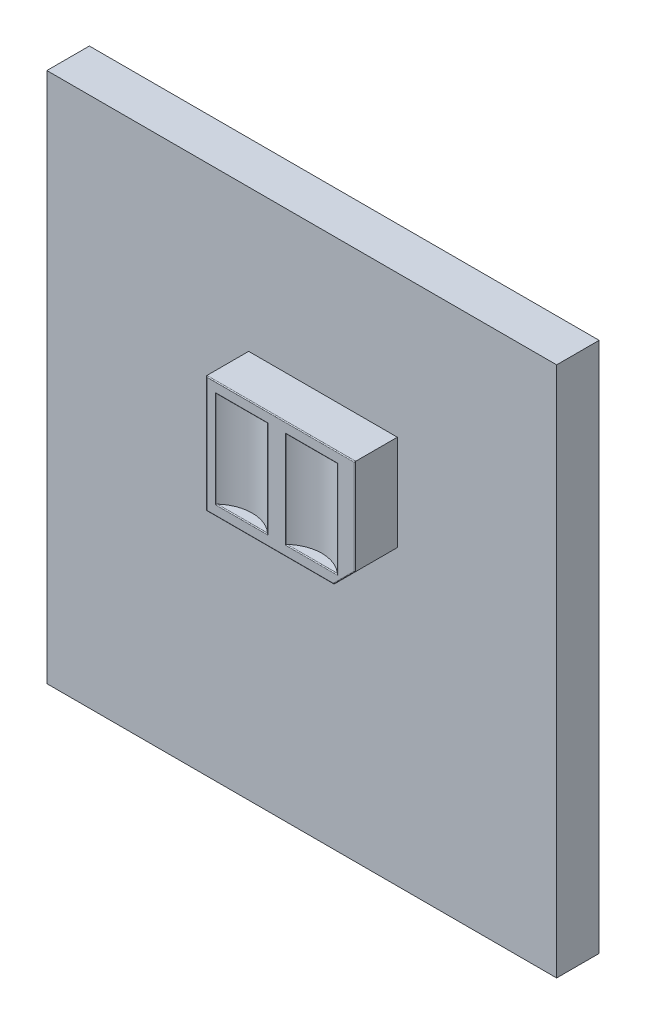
from build123d import *

# Parameters (mm, degrees)
ESQUISSE1_W             = 12
ESQUISSE1_H             = 12.5
EXTRUSION1_DEPTH        = 1
EXTRUSION2_DEPTH        = 2
ENL_V_MAT_EXTRU_1_DEPTH = 2.25
CONG_1_R                = 0.02


with BuildPart() as part:
    # Esquisse1 → Extrusion1 (new body)
    with BuildSketch(Plane.XY):
        Rectangle(ESQUISSE1_W, ESQUISSE1_H)
    extrude(amount=EXTRUSION1_DEPTH)

    # Esquisse3 → Extrusion2 (add)
    with BuildSketch(Plane.XY):
        Polygon((-1.25, 2.9), (2.25, 2.9), (2.25, 0.65), (1.75, 0.15), (-1.25, 0.15), align=None)
    extrude(amount=EXTRUSION2_DEPTH)

    # Esquisse4 → Enl_v. mat.-Extru.1 (cut)
    with BuildSketch(Plane.XZ.offset(-0.4)):
        with BuildLine():
            Line((0.619431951, 2), (1.839642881, 2))
            ThreePointArc((1.839642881, 2), (1.229537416, 1.755105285), (0.619431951, 2))
        make_face()
        with BuildLine():
            Line((0.197380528, 2), (-1.022830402, 2))
            ThreePointArc((-1.022830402, 2), (-0.412724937, 1.755105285), (0.197380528, 2))
        make_face()
    extrude(amount=-ENL_V_MAT_EXTRU_1_DEPTH, mode=Mode.SUBTRACT)

    # Cong_1
    cong_1_edges = [part.edges().sort_by_distance(p)[0] for p in [
        (0.5, 2.9, 2),
        (2.25, 1.775, 2),
        (2, 0.4, 2),
        (0.25, 0.15, 2),
        (-1.25, 1.525, 2),
        (1.229537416, 0.4, 2),
        (0.619431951, 1.525, 2),
        (1.229537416, 2.65, 2),
        (1.839642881, 1.525, 2),
        (-0.412724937, 0.4, 2),
        (-1.022830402, 1.525, 2),
        (-0.412724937, 2.65, 2),
        (0.197380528, 1.525, 2),
    ]]
    fillet(cong_1_edges, radius=CONG_1_R)


solid = part.part
